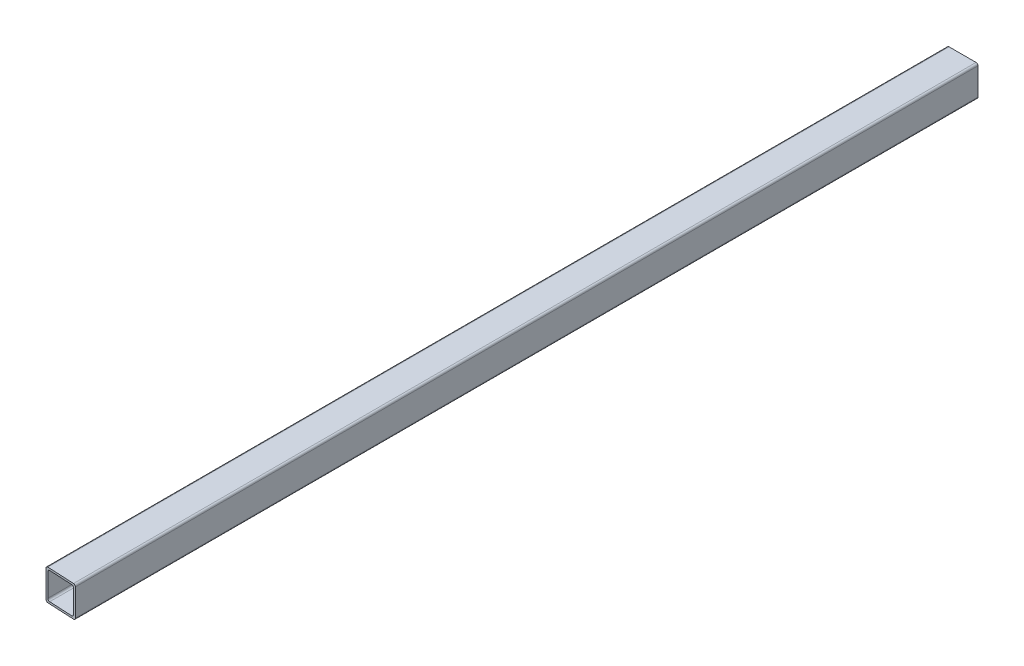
ISO-10303-21;
HEADER;
FILE_DESCRIPTION(('STEP AP214'),'2;1');
FILE_NAME('part.step','',(''),(''),'','','');
FILE_SCHEMA(('AUTOMOTIVE_DESIGN { 1 0 10303 214 1 1 1 1 }'));
ENDSEC;
DATA;
#1=APPLICATION_CONTEXT('core data for automotive mechanical design processes');
#2=APPLICATION_PROTOCOL_DEFINITION('international standard','automotive_design',2000,#1);
#3=PRODUCT_CONTEXT('',#1,'mechanical');
#4=PRODUCT('Part','Part','',(#3));
#5=PRODUCT_RELATED_PRODUCT_CATEGORY('part','',(#4));
#6=PRODUCT_DEFINITION_FORMATION('','',#4);
#7=PRODUCT_DEFINITION_CONTEXT('part definition',#1,'design');
#8=PRODUCT_DEFINITION('design','',#6,#7);
#9=PRODUCT_DEFINITION_SHAPE('','',#8);
#10=(LENGTH_UNIT() NAMED_UNIT(*) SI_UNIT(.MILLI.,.METRE.));
#11=(NAMED_UNIT(*) PLANE_ANGLE_UNIT() SI_UNIT($,.RADIAN.));
#12=(NAMED_UNIT(*) SI_UNIT($,.STERADIAN.) SOLID_ANGLE_UNIT());
#13=UNCERTAINTY_MEASURE_WITH_UNIT(LENGTH_MEASURE(1.E-05),#10,'distance_accuracy_value','');
#14=(GEOMETRIC_REPRESENTATION_CONTEXT(3) GLOBAL_UNCERTAINTY_ASSIGNED_CONTEXT((#13)) GLOBAL_UNIT_ASSIGNED_CONTEXT((#10,
#11,#12)) REPRESENTATION_CONTEXT('',''));
#15=CARTESIAN_POINT('',(0.,0.,0.));
#16=DIRECTION('',(0.,0.,1.));
#17=DIRECTION('',(1.,0.,0.));
#18=AXIS2_PLACEMENT_3D('',#15,#16,#17);
#19=CARTESIAN_POINT('',(-40.,40.0000000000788,2447.20714044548));
#20=DIRECTION('',(1.,0.,0.));
#21=DIRECTION('',(0.,1.,0.));
#22=AXIS2_PLACEMENT_3D('',#19,#20,#21);
#23=PLANE('',#22);
#24=DIRECTION('',(0.,-1.,0.));
#25=VECTOR('',#24,1.);
#26=CARTESIAN_POINT('',(-40.,40.0000000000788,0.));
#27=LINE('',#26,#25);
#28=CARTESIAN_POINT('',(-40.,35.0000000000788,0.));
#29=VERTEX_POINT('',#28);
#30=CARTESIAN_POINT('',(-40.,-34.9999999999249,0.));
#31=VERTEX_POINT('',#30);
#32=EDGE_CURVE('E186',#29,#31,#27,.T.);
#33=ORIENTED_EDGE('',*,*,#32,.T.);
#34=DIRECTION('',(0.,0.,-1.));
#35=VECTOR('',#34,1.);
#36=CARTESIAN_POINT('',(-40.,-34.9999999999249,2447.20714044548));
#37=LINE('',#36,#35);
#38=CARTESIAN_POINT('',(-40.,-34.9999999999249,2331.99939283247));
#39=VERTEX_POINT('',#38);
#40=EDGE_CURVE('E249',#31,#39,#37,.F.);
#41=ORIENTED_EDGE('',*,*,#40,.T.);
#42=DIRECTION('',(0.,-1.,0.));
#43=VECTOR('',#42,1.);
#44=CARTESIAN_POINT('',(-40.,40.0000000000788,2331.99939283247));
#45=LINE('',#44,#43);
#46=CARTESIAN_POINT('',(-40.,35.0000000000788,2331.99939283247));
#47=VERTEX_POINT('',#46);
#48=EDGE_CURVE('E216',#47,#39,#45,.T.);
#49=ORIENTED_EDGE('',*,*,#48,.F.);
#50=DIRECTION('',(0.,0.,-1.));
#51=VECTOR('',#50,1.);
#52=CARTESIAN_POINT('',(-40.,35.0000000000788,2447.20714044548));
#53=LINE('',#52,#51);
#54=EDGE_CURVE('E246',#47,#29,#53,.T.);
#55=ORIENTED_EDGE('',*,*,#54,.T.);
#56=EDGE_LOOP('',(#33,#41,#49,#55));
#57=FACE_BOUND('',#56,.T.);
#58=ADVANCED_FACE('F35',(#57),#23,.F.);
#59=CARTESIAN_POINT('',(-40.,-39.9999999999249,2447.20714044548));
#60=DIRECTION('',(0.,1.,0.));
#61=DIRECTION('',(0.,0.,1.));
#62=AXIS2_PLACEMENT_3D('',#59,#60,#61);
#63=PLANE('',#62);
#64=DIRECTION('',(1.,0.,0.));
#65=VECTOR('',#64,1.);
#66=CARTESIAN_POINT('',(-40.,-39.9999999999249,0.));
#67=LINE('',#66,#65);
#68=CARTESIAN_POINT('',(-35.,-39.9999999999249,0.));
#69=VERTEX_POINT('',#68);
#70=CARTESIAN_POINT('',(35.,-39.9999999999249,0.));
#71=VERTEX_POINT('',#70);
#72=EDGE_CURVE('E204',#69,#71,#67,.T.);
#73=ORIENTED_EDGE('',*,*,#72,.T.);
#74=DIRECTION('',(0.,0.,-1.));
#75=VECTOR('',#74,1.);
#76=CARTESIAN_POINT('',(35.,-39.9999999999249,2447.20714044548));
#77=LINE('',#76,#75);
#78=CARTESIAN_POINT('',(35.,-39.9999999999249,2335.74938597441));
#79=VERTEX_POINT('',#78);
#80=EDGE_CURVE('E236',#71,#79,#77,.F.);
#81=ORIENTED_EDGE('',*,*,#80,.T.);
#82=DIRECTION('',(0.998752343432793,0.,0.0499375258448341));
#83=VECTOR('',#82,1.);
#84=CARTESIAN_POINT('',(-34.2539881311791,-39.9999999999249,2332.28669290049));
#85=LINE('',#84,#83);
#86=CARTESIAN_POINT('',(-35.,-39.9999999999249,2332.24939237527));
#87=VERTEX_POINT('',#86);
#88=EDGE_CURVE('E213',#87,#79,#85,.T.);
#89=ORIENTED_EDGE('',*,*,#88,.F.);
#90=DIRECTION('',(0.,0.,-1.));
#91=VECTOR('',#90,1.);
#92=CARTESIAN_POINT('',(-35.,-39.9999999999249,2447.20714044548));
#93=LINE('',#92,#91);
#94=EDGE_CURVE('E233',#87,#69,#93,.T.);
#95=ORIENTED_EDGE('',*,*,#94,.T.);
#96=EDGE_LOOP('',(#73,#81,#89,#95));
#97=FACE_BOUND('',#96,.T.);
#98=ADVANCED_FACE('F306',(#97),#63,.F.);
#99=CARTESIAN_POINT('',(40.,40.0000000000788,2447.20714044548));
#100=DIRECTION('',(-1.,0.,0.));
#101=DIRECTION('',(0.,-1.,0.));
#102=AXIS2_PLACEMENT_3D('',#99,#100,#101);
#103=PLANE('',#102);
#104=DIRECTION('',(0.,1.,0.));
#105=VECTOR('',#104,1.);
#106=CARTESIAN_POINT('',(40.,40.0000000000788,2335.9993855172));
#107=LINE('',#106,#105);
#108=CARTESIAN_POINT('',(40.,-34.9999999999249,2335.9993855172));
#109=VERTEX_POINT('',#108);
#110=CARTESIAN_POINT('',(40.,35.0000000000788,2335.9993855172));
#111=VERTEX_POINT('',#110);
#112=EDGE_CURVE('E209',#109,#111,#107,.T.);
#113=ORIENTED_EDGE('',*,*,#112,.F.);
#114=DIRECTION('',(0.,0.,-1.));
#115=VECTOR('',#114,1.);
#116=CARTESIAN_POINT('',(40.,-34.9999999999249,2447.20714044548));
#117=LINE('',#116,#115);
#118=CARTESIAN_POINT('',(40.,-34.9999999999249,0.));
#119=VERTEX_POINT('',#118);
#120=EDGE_CURVE('E222',#109,#119,#117,.T.);
#121=ORIENTED_EDGE('',*,*,#120,.T.);
#122=DIRECTION('',(0.,1.,0.));
#123=VECTOR('',#122,1.);
#124=CARTESIAN_POINT('',(40.,40.0000000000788,0.));
#125=LINE('',#124,#123);
#126=CARTESIAN_POINT('',(40.,35.0000000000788,0.));
#127=VERTEX_POINT('',#126);
#128=EDGE_CURVE('E201',#119,#127,#125,.T.);
#129=ORIENTED_EDGE('',*,*,#128,.T.);
#130=DIRECTION('',(0.,0.,-1.));
#131=VECTOR('',#130,1.);
#132=CARTESIAN_POINT('',(40.,35.0000000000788,2447.20714044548));
#133=LINE('',#132,#131);
#134=EDGE_CURVE('E212',#127,#111,#133,.F.);
#135=ORIENTED_EDGE('',*,*,#134,.T.);
#136=EDGE_LOOP('',(#113,#121,#129,#135));
#137=FACE_BOUND('',#136,.T.);
#138=ADVANCED_FACE('F312',(#137),#103,.F.);
#139=CARTESIAN_POINT('',(-40.,40.0000000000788,2447.20714044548));
#140=DIRECTION('',(0.,-1.,0.));
#141=DIRECTION('',(0.,0.,-1.));
#142=AXIS2_PLACEMENT_3D('',#139,#140,#141);
#143=PLANE('',#142);
#144=DIRECTION('',(-0.998752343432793,0.,-0.0499375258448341));
#145=VECTOR('',#144,1.);
#146=CARTESIAN_POINT('',(-34.2539881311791,40.0000000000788,2332.28669290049));
#147=LINE('',#146,#145);
#148=CARTESIAN_POINT('',(35.,40.0000000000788,2335.74938597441));
#149=VERTEX_POINT('',#148);
#150=CARTESIAN_POINT('',(-35.,40.0000000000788,2332.24939237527));
#151=VERTEX_POINT('',#150);
#152=EDGE_CURVE('E200',#149,#151,#147,.T.);
#153=ORIENTED_EDGE('',*,*,#152,.F.);
#154=DIRECTION('',(0.,0.,-1.));
#155=VECTOR('',#154,1.);
#156=CARTESIAN_POINT('',(35.,40.0000000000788,2447.20714044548));
#157=LINE('',#156,#155);
#158=CARTESIAN_POINT('',(35.,40.0000000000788,0.));
#159=VERTEX_POINT('',#158);
#160=EDGE_CURVE('E253',#149,#159,#157,.T.);
#161=ORIENTED_EDGE('',*,*,#160,.T.);
#162=DIRECTION('',(-1.,0.,0.));
#163=VECTOR('',#162,1.);
#164=CARTESIAN_POINT('',(-40.,40.0000000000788,0.));
#165=LINE('',#164,#163);
#166=CARTESIAN_POINT('',(-35.,40.0000000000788,0.));
#167=VERTEX_POINT('',#166);
#168=EDGE_CURVE('E197',#159,#167,#165,.T.);
#169=ORIENTED_EDGE('',*,*,#168,.T.);
#170=DIRECTION('',(0.,0.,-1.));
#171=VECTOR('',#170,1.);
#172=CARTESIAN_POINT('',(-35.,40.0000000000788,2447.20714044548));
#173=LINE('',#172,#171);
#174=EDGE_CURVE('E251',#167,#151,#173,.F.);
#175=ORIENTED_EDGE('',*,*,#174,.T.);
#176=EDGE_LOOP('',(#153,#161,#169,#175));
#177=FACE_BOUND('',#176,.T.);
#178=ADVANCED_FACE('F337',(#177),#143,.F.);
#179=CARTESIAN_POINT('',(0.,0.,0.));
#180=DIRECTION('',(0.,0.,1.));
#181=DIRECTION('',(1.,0.,0.));
#182=AXIS2_PLACEMENT_3D('',#179,#180,#181);
#183=PLANE('',#182);
#184=DIRECTION('',(1.,0.,0.));
#185=VECTOR('',#184,1.);
#186=CARTESIAN_POINT('',(30.,35.0000000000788,0.));
#187=LINE('',#186,#185);
#188=CARTESIAN_POINT('',(-30.,35.0000000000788,0.));
#189=VERTEX_POINT('',#188);
#190=CARTESIAN_POINT('',(30.,35.0000000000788,0.));
#191=VERTEX_POINT('',#190);
#192=EDGE_CURVE('E159',#189,#191,#187,.T.);
#193=ORIENTED_EDGE('',*,*,#192,.F.);
#194=CARTESIAN_POINT('',(-30.,30.0000000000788,0.));
#195=DIRECTION('',(0.,0.,-1.));
#196=DIRECTION('',(1.,0.,0.));
#197=AXIS2_PLACEMENT_3D('',#194,#195,#196);
#198=CIRCLE('',#197,5.);
#199=CARTESIAN_POINT('',(-35.,30.0000000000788,0.));
#200=VERTEX_POINT('',#199);
#201=EDGE_CURVE('E50',#200,#189,#198,.T.);
#202=ORIENTED_EDGE('',*,*,#201,.F.);
#203=DIRECTION('',(0.,1.,0.));
#204=VECTOR('',#203,1.);
#205=CARTESIAN_POINT('',(-35.,-29.9999999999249,0.));
#206=LINE('',#205,#204);
#207=CARTESIAN_POINT('',(-35.,-29.9999999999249,0.));
#208=VERTEX_POINT('',#207);
#209=EDGE_CURVE('E181',#208,#200,#206,.T.);
#210=ORIENTED_EDGE('',*,*,#209,.F.);
#211=CARTESIAN_POINT('',(-30.,-29.9999999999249,0.));
#212=DIRECTION('',(0.,0.,-1.));
#213=DIRECTION('',(1.,0.,0.));
#214=AXIS2_PLACEMENT_3D('',#211,#212,#213);
#215=CIRCLE('',#214,5.);
#216=CARTESIAN_POINT('',(-30.,-34.9999999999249,0.));
#217=VERTEX_POINT('',#216);
#218=EDGE_CURVE('E178',#217,#208,#215,.T.);
#219=ORIENTED_EDGE('',*,*,#218,.F.);
#220=DIRECTION('',(-1.,0.,0.));
#221=VECTOR('',#220,1.);
#222=CARTESIAN_POINT('',(30.,-34.9999999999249,0.));
#223=LINE('',#222,#221);
#224=CARTESIAN_POINT('',(30.,-34.9999999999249,0.));
#225=VERTEX_POINT('',#224);
#226=EDGE_CURVE('E175',#225,#217,#223,.T.);
#227=ORIENTED_EDGE('',*,*,#226,.F.);
#228=CARTESIAN_POINT('',(30.,-29.9999999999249,0.));
#229=DIRECTION('',(0.,0.,-1.));
#230=DIRECTION('',(1.,0.,0.));
#231=AXIS2_PLACEMENT_3D('',#228,#229,#230);
#232=CIRCLE('',#231,5.);
#233=CARTESIAN_POINT('',(35.,-29.9999999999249,0.));
#234=VERTEX_POINT('',#233);
#235=EDGE_CURVE('E169',#234,#225,#232,.T.);
#236=ORIENTED_EDGE('',*,*,#235,.F.);
#237=DIRECTION('',(0.,-1.,0.));
#238=VECTOR('',#237,1.);
#239=CARTESIAN_POINT('',(35.,-29.9999999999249,0.));
#240=LINE('',#239,#238);
#241=CARTESIAN_POINT('',(35.,30.0000000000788,0.));
#242=VERTEX_POINT('',#241);
#243=EDGE_CURVE('E167',#242,#234,#240,.T.);
#244=ORIENTED_EDGE('',*,*,#243,.F.);
#245=CARTESIAN_POINT('',(30.,30.0000000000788,0.));
#246=DIRECTION('',(0.,0.,-1.));
#247=DIRECTION('',(1.,0.,0.));
#248=AXIS2_PLACEMENT_3D('',#245,#246,#247);
#249=CIRCLE('',#248,5.);
#250=EDGE_CURVE('E150',#191,#242,#249,.T.);
#251=ORIENTED_EDGE('',*,*,#250,.F.);
#252=EDGE_LOOP('',(#193,#202,#210,#219,#227,#236,#244,#251));
#253=FACE_BOUND('',#252,.T.);
#254=ORIENTED_EDGE('',*,*,#128,.F.);
#255=CARTESIAN_POINT('',(35.,-34.9999999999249,0.));
#256=DIRECTION('',(0.,0.,1.));
#257=DIRECTION('',(1.,0.,0.));
#258=AXIS2_PLACEMENT_3D('',#255,#256,#257);
#259=CIRCLE('',#258,5.);
#260=EDGE_CURVE('E231',#119,#71,#259,.F.);
#261=ORIENTED_EDGE('',*,*,#260,.T.);
#262=ORIENTED_EDGE('',*,*,#72,.F.);
#263=CARTESIAN_POINT('',(-35.,-34.9999999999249,0.));
#264=DIRECTION('',(0.,0.,1.));
#265=DIRECTION('',(1.,0.,0.));
#266=AXIS2_PLACEMENT_3D('',#263,#264,#265);
#267=CIRCLE('',#266,5.);
#268=EDGE_CURVE('E229',#69,#31,#267,.F.);
#269=ORIENTED_EDGE('',*,*,#268,.T.);
#270=ORIENTED_EDGE('',*,*,#32,.F.);
#271=CARTESIAN_POINT('',(-35.,35.0000000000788,0.));
#272=DIRECTION('',(0.,0.,1.));
#273=DIRECTION('',(1.,0.,0.));
#274=AXIS2_PLACEMENT_3D('',#271,#272,#273);
#275=CIRCLE('',#274,5.);
#276=EDGE_CURVE('E225',#29,#167,#275,.F.);
#277=ORIENTED_EDGE('',*,*,#276,.T.);
#278=ORIENTED_EDGE('',*,*,#168,.F.);
#279=CARTESIAN_POINT('',(35.,35.0000000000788,0.));
#280=DIRECTION('',(0.,0.,1.));
#281=DIRECTION('',(1.,0.,0.));
#282=AXIS2_PLACEMENT_3D('',#279,#280,#281);
#283=CIRCLE('',#282,5.);
#284=EDGE_CURVE('E227',#159,#127,#283,.F.);
#285=ORIENTED_EDGE('',*,*,#284,.T.);
#286=EDGE_LOOP('',(#254,#261,#262,#269,#270,#277,#278,#285));
#287=FACE_BOUND('',#286,.T.);
#288=ADVANCED_FACE('F163',(#253,#287),#183,.F.);
#289=CARTESIAN_POINT('',(-6863.28104984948,40.0000000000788,1990.83596426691));
#290=DIRECTION('',(-0.0499375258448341,0.,0.998752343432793));
#291=DIRECTION('',(-0.998752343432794,0.,-0.049937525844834));
#292=AXIS2_PLACEMENT_3D('',#289,#290,#291);
#293=PLANE('',#292);
#294=CARTESIAN_POINT('',(-30.,30.0000000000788,2332.49939191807));
#295=DIRECTION('',(-0.0499375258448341,0.,0.998752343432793));
#296=DIRECTION('',(-0.998752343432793,0.,-0.0499375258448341));
#297=AXIS2_PLACEMENT_3D('',#294,#295,#296);
#298=ELLIPSE('',#297,5.00624607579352,5.);
#299=CARTESIAN_POINT('',(-30.0000000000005,35.0000000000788,2332.49939191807));
#300=VERTEX_POINT('',#299);
#301=CARTESIAN_POINT('',(-35.,30.0000000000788,2332.24939237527));
#302=VERTEX_POINT('',#301);
#303=EDGE_CURVE('E11',#300,#302,#298,.T.);
#304=ORIENTED_EDGE('',*,*,#303,.F.);
#305=DIRECTION('',(-0.998752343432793,0.,-0.0499375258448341));
#306=VECTOR('',#305,1.);
#307=CARTESIAN_POINT('',(-6863.28104984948,35.0000000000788,1990.83596426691));
#308=LINE('',#307,#306);
#309=CARTESIAN_POINT('',(30.0000000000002,35.0000000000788,2335.49938643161));
#310=VERTEX_POINT('',#309);
#311=EDGE_CURVE('E256',#310,#300,#308,.T.);
#312=ORIENTED_EDGE('',*,*,#311,.F.);
#313=CARTESIAN_POINT('',(30.,30.0000000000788,2335.49938643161));
#314=DIRECTION('',(-0.0499375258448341,0.,0.998752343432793));
#315=DIRECTION('',(-0.998752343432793,0.,-0.0499375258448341));
#316=AXIS2_PLACEMENT_3D('',#313,#314,#315);
#317=ELLIPSE('',#316,5.00624607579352,5.);
#318=CARTESIAN_POINT('',(35.,30.0000000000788,2335.74938597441));
#319=VERTEX_POINT('',#318);
#320=EDGE_CURVE('E153',#319,#310,#317,.T.);
#321=ORIENTED_EDGE('',*,*,#320,.F.);
#322=DIRECTION('',(0.,1.,0.));
#323=VECTOR('',#322,1.);
#324=CARTESIAN_POINT('',(35.0000000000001,40.0000000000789,2335.74938597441));
#325=LINE('',#324,#323);
#326=CARTESIAN_POINT('',(35.,-29.9999999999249,2335.74938597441));
#327=VERTEX_POINT('',#326);
#328=EDGE_CURVE('E259',#327,#319,#325,.T.);
#329=ORIENTED_EDGE('',*,*,#328,.F.);
#330=CARTESIAN_POINT('',(30.,-29.9999999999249,2335.49938643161));
#331=DIRECTION('',(-0.0499375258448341,0.,0.998752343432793));
#332=DIRECTION('',(-0.998752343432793,0.,-0.0499375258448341));
#333=AXIS2_PLACEMENT_3D('',#330,#331,#332);
#334=ELLIPSE('',#333,5.00624607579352,5.);
#335=CARTESIAN_POINT('',(30.,-34.9999999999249,2335.49938643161));
#336=VERTEX_POINT('',#335);
#337=EDGE_CURVE('E261',#336,#327,#334,.T.);
#338=ORIENTED_EDGE('',*,*,#337,.F.);
#339=DIRECTION('',(0.998752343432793,0.,0.0499375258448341));
#340=VECTOR('',#339,1.);
#341=CARTESIAN_POINT('',(-6863.28104984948,-34.9999999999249,1990.83596426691));
#342=LINE('',#341,#340);
#343=CARTESIAN_POINT('',(-30.0000000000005,-34.9999999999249,2332.49939191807));
#344=VERTEX_POINT('',#343);
#345=EDGE_CURVE('E263',#344,#336,#342,.T.);
#346=ORIENTED_EDGE('',*,*,#345,.F.);
#347=CARTESIAN_POINT('',(-30.,-29.9999999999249,2332.49939191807));
#348=DIRECTION('',(-0.0499375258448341,0.,0.998752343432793));
#349=DIRECTION('',(-0.998752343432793,0.,-0.0499375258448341));
#350=AXIS2_PLACEMENT_3D('',#347,#348,#349);
#351=ELLIPSE('',#350,5.00624607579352,5.);
#352=CARTESIAN_POINT('',(-35.,-29.9999999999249,2332.24939237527));
#353=VERTEX_POINT('',#352);
#354=EDGE_CURVE('E265',#353,#344,#351,.T.);
#355=ORIENTED_EDGE('',*,*,#354,.F.);
#356=DIRECTION('',(0.,-1.,0.));
#357=VECTOR('',#356,1.);
#358=CARTESIAN_POINT('',(-35.0000000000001,40.0000000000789,2332.24939237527));
#359=LINE('',#358,#357);
#360=EDGE_CURVE('E43',#302,#353,#359,.T.);
#361=ORIENTED_EDGE('',*,*,#360,.F.);
#362=EDGE_LOOP('',(#304,#312,#321,#329,#338,#346,#355,#361));
#363=FACE_BOUND('',#362,.T.);
#364=ORIENTED_EDGE('',*,*,#88,.T.);
#365=CARTESIAN_POINT('',(35.,-34.9999999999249,2335.74938597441));
#366=DIRECTION('',(-0.0499375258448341,0.,0.998752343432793));
#367=DIRECTION('',(-0.998752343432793,0.,-0.0499375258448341));
#368=AXIS2_PLACEMENT_3D('',#365,#366,#367);
#369=ELLIPSE('',#368,5.00624607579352,5.);
#370=EDGE_CURVE('E244',#79,#109,#369,.T.);
#371=ORIENTED_EDGE('',*,*,#370,.T.);
#372=ORIENTED_EDGE('',*,*,#112,.T.);
#373=CARTESIAN_POINT('',(35.,35.0000000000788,2335.74938597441));
#374=DIRECTION('',(-0.0499375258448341,0.,0.998752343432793));
#375=DIRECTION('',(-0.998752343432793,0.,-0.0499375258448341));
#376=AXIS2_PLACEMENT_3D('',#373,#374,#375);
#377=ELLIPSE('',#376,5.00624607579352,5.);
#378=EDGE_CURVE('E240',#111,#149,#377,.T.);
#379=ORIENTED_EDGE('',*,*,#378,.T.);
#380=ORIENTED_EDGE('',*,*,#152,.T.);
#381=CARTESIAN_POINT('',(-35.,35.0000000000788,2332.24939237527));
#382=DIRECTION('',(-0.0499375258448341,0.,0.998752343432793));
#383=DIRECTION('',(-0.998752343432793,0.,-0.0499375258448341));
#384=AXIS2_PLACEMENT_3D('',#381,#382,#383);
#385=ELLIPSE('',#384,5.00624607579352,5.);
#386=EDGE_CURVE('E238',#151,#47,#385,.T.);
#387=ORIENTED_EDGE('',*,*,#386,.T.);
#388=ORIENTED_EDGE('',*,*,#48,.T.);
#389=CARTESIAN_POINT('',(-35.,-34.9999999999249,2332.24939237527));
#390=DIRECTION('',(-0.0499375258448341,0.,0.998752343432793));
#391=DIRECTION('',(-0.998752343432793,0.,-0.0499375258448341));
#392=AXIS2_PLACEMENT_3D('',#389,#390,#391);
#393=ELLIPSE('',#392,5.00624607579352,5.);
#394=EDGE_CURVE('E242',#39,#87,#393,.T.);
#395=ORIENTED_EDGE('',*,*,#394,.T.);
#396=EDGE_LOOP('',(#364,#371,#372,#379,#380,#387,#388,#395));
#397=FACE_BOUND('',#396,.T.);
#398=ADVANCED_FACE('F280',(#363,#397),#293,.T.);
#399=CARTESIAN_POINT('',(35.,-34.9999999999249,2447.20714044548));
#400=DIRECTION('',(0.,0.,-1.));
#401=DIRECTION('',(-1.,0.,0.));
#402=AXIS2_PLACEMENT_3D('',#399,#400,#401);
#403=CYLINDRICAL_SURFACE('',#402,5.);
#404=ORIENTED_EDGE('',*,*,#370,.F.);
#405=ORIENTED_EDGE('',*,*,#80,.F.);
#406=ORIENTED_EDGE('',*,*,#260,.F.);
#407=ORIENTED_EDGE('',*,*,#120,.F.);
#408=EDGE_LOOP('',(#404,#405,#406,#407));
#409=FACE_BOUND('',#408,.T.);
#410=ADVANCED_FACE('F319',(#409),#403,.T.);
#411=CARTESIAN_POINT('',(-35.,-34.9999999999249,2447.20714044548));
#412=DIRECTION('',(0.,0.,-1.));
#413=DIRECTION('',(-1.,0.,0.));
#414=AXIS2_PLACEMENT_3D('',#411,#412,#413);
#415=CYLINDRICAL_SURFACE('',#414,5.);
#416=ORIENTED_EDGE('',*,*,#394,.F.);
#417=ORIENTED_EDGE('',*,*,#40,.F.);
#418=ORIENTED_EDGE('',*,*,#268,.F.);
#419=ORIENTED_EDGE('',*,*,#94,.F.);
#420=EDGE_LOOP('',(#416,#417,#418,#419));
#421=FACE_BOUND('',#420,.T.);
#422=ADVANCED_FACE('F322',(#421),#415,.T.);
#423=CARTESIAN_POINT('',(35.,35.0000000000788,2447.20714044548));
#424=DIRECTION('',(0.,0.,-1.));
#425=DIRECTION('',(-1.,0.,0.));
#426=AXIS2_PLACEMENT_3D('',#423,#424,#425);
#427=CYLINDRICAL_SURFACE('',#426,5.);
#428=ORIENTED_EDGE('',*,*,#378,.F.);
#429=ORIENTED_EDGE('',*,*,#134,.F.);
#430=ORIENTED_EDGE('',*,*,#284,.F.);
#431=ORIENTED_EDGE('',*,*,#160,.F.);
#432=EDGE_LOOP('',(#428,#429,#430,#431));
#433=FACE_BOUND('',#432,.T.);
#434=ADVANCED_FACE('F301',(#433),#427,.T.);
#435=CARTESIAN_POINT('',(-35.,35.0000000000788,2447.20714044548));
#436=DIRECTION('',(0.,0.,-1.));
#437=DIRECTION('',(-1.,0.,0.));
#438=AXIS2_PLACEMENT_3D('',#435,#436,#437);
#439=CYLINDRICAL_SURFACE('',#438,5.);
#440=ORIENTED_EDGE('',*,*,#386,.F.);
#441=ORIENTED_EDGE('',*,*,#174,.F.);
#442=ORIENTED_EDGE('',*,*,#276,.F.);
#443=ORIENTED_EDGE('',*,*,#54,.F.);
#444=EDGE_LOOP('',(#440,#441,#442,#443));
#445=FACE_BOUND('',#444,.T.);
#446=ADVANCED_FACE('F37',(#445),#439,.T.);
#447=CARTESIAN_POINT('',(-30.,30.0000000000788,2335.9993855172));
#448=DIRECTION('',(0.,0.,-1.));
#449=DIRECTION('',(-1.,0.,0.));
#450=AXIS2_PLACEMENT_3D('',#447,#448,#449);
#451=CYLINDRICAL_SURFACE('',#450,5.);
#452=ORIENTED_EDGE('',*,*,#303,.T.);
#453=DIRECTION('',(0.,0.,-1.));
#454=VECTOR('',#453,1.);
#455=CARTESIAN_POINT('',(-35.,30.0000000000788,2335.9993855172));
#456=LINE('',#455,#454);
#457=EDGE_CURVE('E184',#302,#200,#456,.T.);
#458=ORIENTED_EDGE('',*,*,#457,.T.);
#459=ORIENTED_EDGE('',*,*,#201,.T.);
#460=DIRECTION('',(0.,0.,-1.));
#461=VECTOR('',#460,1.);
#462=CARTESIAN_POINT('',(-30.,35.0000000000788,2335.9993855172));
#463=LINE('',#462,#461);
#464=EDGE_CURVE('E156',#300,#189,#463,.T.);
#465=ORIENTED_EDGE('',*,*,#464,.F.);
#466=EDGE_LOOP('',(#452,#458,#459,#465));
#467=FACE_BOUND('',#466,.T.);
#468=ADVANCED_FACE('F293',(#467),#451,.F.);
#469=CARTESIAN_POINT('',(-35.,-29.9999999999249,2335.9993855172));
#470=DIRECTION('',(-1.,0.,0.));
#471=DIRECTION('',(0.,0.,1.));
#472=AXIS2_PLACEMENT_3D('',#469,#470,#471);
#473=PLANE('',#472);
#474=ORIENTED_EDGE('',*,*,#360,.T.);
#475=DIRECTION('',(0.,0.,-1.));
#476=VECTOR('',#475,1.);
#477=CARTESIAN_POINT('',(-35.,-29.9999999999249,2335.9993855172));
#478=LINE('',#477,#476);
#479=EDGE_CURVE('E187',#353,#208,#478,.T.);
#480=ORIENTED_EDGE('',*,*,#479,.T.);
#481=ORIENTED_EDGE('',*,*,#209,.T.);
#482=ORIENTED_EDGE('',*,*,#457,.F.);
#483=EDGE_LOOP('',(#474,#480,#481,#482));
#484=FACE_BOUND('',#483,.T.);
#485=ADVANCED_FACE('F270',(#484),#473,.F.);
#486=CARTESIAN_POINT('',(-30.,-29.9999999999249,2335.9993855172));
#487=DIRECTION('',(0.,0.,-1.));
#488=DIRECTION('',(-1.,0.,0.));
#489=AXIS2_PLACEMENT_3D('',#486,#487,#488);
#490=CYLINDRICAL_SURFACE('',#489,5.);
#491=ORIENTED_EDGE('',*,*,#354,.T.);
#492=DIRECTION('',(0.,0.,-1.));
#493=VECTOR('',#492,1.);
#494=CARTESIAN_POINT('',(-30.,-34.9999999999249,2335.9993855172));
#495=LINE('',#494,#493);
#496=EDGE_CURVE('E189',#344,#217,#495,.T.);
#497=ORIENTED_EDGE('',*,*,#496,.T.);
#498=ORIENTED_EDGE('',*,*,#218,.T.);
#499=ORIENTED_EDGE('',*,*,#479,.F.);
#500=EDGE_LOOP('',(#491,#497,#498,#499));
#501=FACE_BOUND('',#500,.T.);
#502=ADVANCED_FACE('F275',(#501),#490,.F.);
#503=CARTESIAN_POINT('',(30.,-34.9999999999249,2335.9993855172));
#504=DIRECTION('',(0.,-1.,0.));
#505=DIRECTION('',(0.,0.,-1.));
#506=AXIS2_PLACEMENT_3D('',#503,#504,#505);
#507=PLANE('',#506);
#508=ORIENTED_EDGE('',*,*,#345,.T.);
#509=DIRECTION('',(0.,0.,-1.));
#510=VECTOR('',#509,1.);
#511=CARTESIAN_POINT('',(30.,-34.9999999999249,2335.9993855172));
#512=LINE('',#511,#510);
#513=EDGE_CURVE('E191',#336,#225,#512,.T.);
#514=ORIENTED_EDGE('',*,*,#513,.T.);
#515=ORIENTED_EDGE('',*,*,#226,.T.);
#516=ORIENTED_EDGE('',*,*,#496,.F.);
#517=EDGE_LOOP('',(#508,#514,#515,#516));
#518=FACE_BOUND('',#517,.T.);
#519=ADVANCED_FACE('F286',(#518),#507,.F.);
#520=CARTESIAN_POINT('',(30.,-29.9999999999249,2335.9993855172));
#521=DIRECTION('',(0.,0.,-1.));
#522=DIRECTION('',(-1.,0.,0.));
#523=AXIS2_PLACEMENT_3D('',#520,#521,#522);
#524=CYLINDRICAL_SURFACE('',#523,5.);
#525=ORIENTED_EDGE('',*,*,#337,.T.);
#526=DIRECTION('',(0.,0.,-1.));
#527=VECTOR('',#526,1.);
#528=CARTESIAN_POINT('',(35.,-29.9999999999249,2335.9993855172));
#529=LINE('',#528,#527);
#530=EDGE_CURVE('E193',#327,#234,#529,.T.);
#531=ORIENTED_EDGE('',*,*,#530,.T.);
#532=ORIENTED_EDGE('',*,*,#235,.T.);
#533=ORIENTED_EDGE('',*,*,#513,.F.);
#534=EDGE_LOOP('',(#525,#531,#532,#533));
#535=FACE_BOUND('',#534,.T.);
#536=ADVANCED_FACE('F288',(#535),#524,.F.);
#537=CARTESIAN_POINT('',(35.,-29.9999999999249,2335.9993855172));
#538=DIRECTION('',(1.,0.,0.));
#539=DIRECTION('',(0.,0.,-1.));
#540=AXIS2_PLACEMENT_3D('',#537,#538,#539);
#541=PLANE('',#540);
#542=ORIENTED_EDGE('',*,*,#328,.T.);
#543=DIRECTION('',(0.,0.,-1.));
#544=VECTOR('',#543,1.);
#545=CARTESIAN_POINT('',(35.,30.0000000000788,2335.9993855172));
#546=LINE('',#545,#544);
#547=EDGE_CURVE('E155',#319,#242,#546,.T.);
#548=ORIENTED_EDGE('',*,*,#547,.T.);
#549=ORIENTED_EDGE('',*,*,#243,.T.);
#550=ORIENTED_EDGE('',*,*,#530,.F.);
#551=EDGE_LOOP('',(#542,#548,#549,#550));
#552=FACE_BOUND('',#551,.T.);
#553=ADVANCED_FACE('F292',(#552),#541,.F.);
#554=CARTESIAN_POINT('',(30.,30.0000000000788,2335.9993855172));
#555=DIRECTION('',(0.,0.,-1.));
#556=DIRECTION('',(-1.,0.,0.));
#557=AXIS2_PLACEMENT_3D('',#554,#555,#556);
#558=CYLINDRICAL_SURFACE('',#557,5.);
#559=ORIENTED_EDGE('',*,*,#320,.T.);
#560=DIRECTION('',(0.,0.,-1.));
#561=VECTOR('',#560,1.);
#562=CARTESIAN_POINT('',(30.,35.0000000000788,2335.9993855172));
#563=LINE('',#562,#561);
#564=EDGE_CURVE('E58',#310,#191,#563,.T.);
#565=ORIENTED_EDGE('',*,*,#564,.T.);
#566=ORIENTED_EDGE('',*,*,#250,.T.);
#567=ORIENTED_EDGE('',*,*,#547,.F.);
#568=EDGE_LOOP('',(#559,#565,#566,#567));
#569=FACE_BOUND('',#568,.T.);
#570=ADVANCED_FACE('F147',(#569),#558,.F.);
#571=CARTESIAN_POINT('',(30.,35.0000000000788,2335.9993855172));
#572=DIRECTION('',(0.,1.,0.));
#573=DIRECTION('',(0.,0.,1.));
#574=AXIS2_PLACEMENT_3D('',#571,#572,#573);
#575=PLANE('',#574);
#576=ORIENTED_EDGE('',*,*,#311,.T.);
#577=ORIENTED_EDGE('',*,*,#464,.T.);
#578=ORIENTED_EDGE('',*,*,#192,.T.);
#579=ORIENTED_EDGE('',*,*,#564,.F.);
#580=EDGE_LOOP('',(#576,#577,#578,#579));
#581=FACE_BOUND('',#580,.T.);
#582=ADVANCED_FACE('F160',(#581),#575,.F.);
#583=CLOSED_SHELL('',(#58,#98,#138,#178,#288,#398,#410,#422,#434,#446,#468,#485,#502,#519,#536,
#553,#570,#582));
#584=MANIFOLD_SOLID_BREP('B2',#583);
#585=ADVANCED_BREP_SHAPE_REPRESENTATION('',(#18,#584),#14);
#586=SHAPE_DEFINITION_REPRESENTATION(#9,#585);
ENDSEC;
END-ISO-10303-21;
